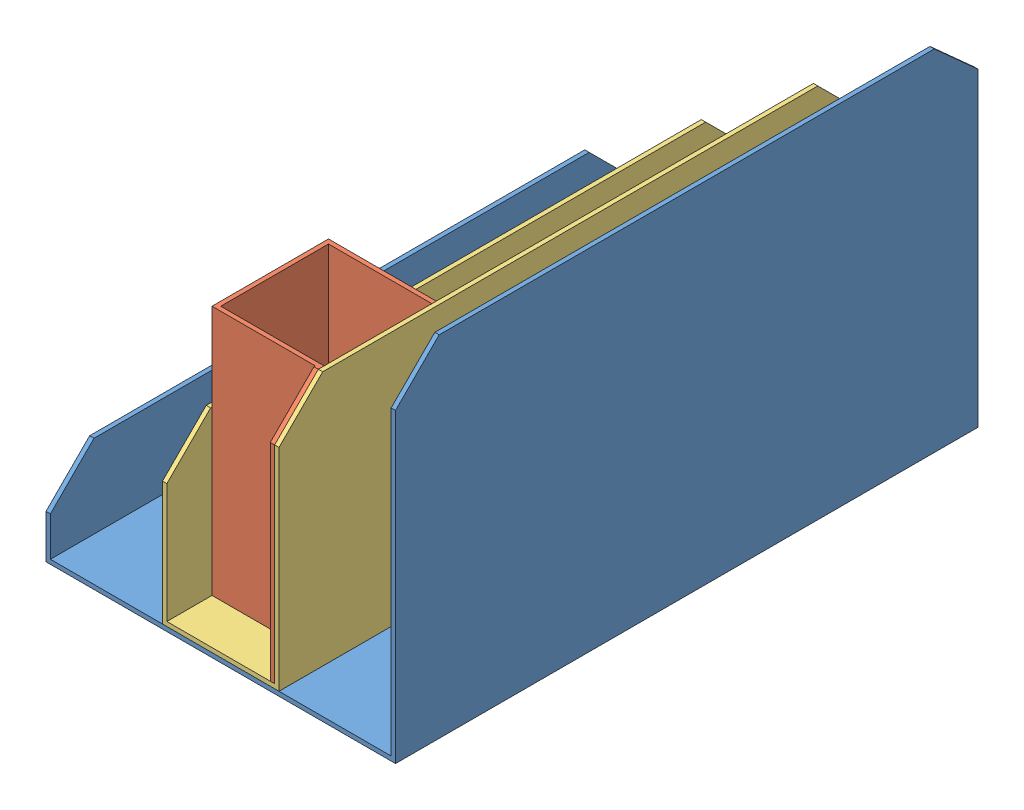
SolidWorks assembly Assemblage du pot.SLDASM, configuration Défaut (file format 3400). Lengths in mm.
Overall size (120 120 200).
3 component instances, 3 part files, 5 mates.
Components (placement in the parent):
- Range crayon-1: Range crayon.SLDPRT [Défaut] at origin size (120 120 200)
- pot-1: pot.SLDPRT [Défaut] at (77 1.5 146) x (0 0 1) z (0 1 0) size (55.5 37 86)
- Range crayon2-1: Range crayon2.SLDPRT [Défaut] at (40 1.5 0) size (40 87.5 200)
Mates (geometry in assembly coordinates):
- Distance1: distance = 38.5 mm anti-aligned: plane of Range crayon-1 through (0 28.5 200) normal (1 0 0); plane of Range crayon2-1 through (38.5 57.5 200) normal (-1 0 0)
- Coïncidente3: coincident aligned: plane of Range crayon-1 through (117 28.5 200) normal (0 0 1); plane of Range crayon2-1 through (78.5 57.5 200) normal (0 0 1)
- Coïncidente6: coincident anti-aligned: plane of pot-1 through (77 1.5 183) normal (0 -1 0); plane of Range crayon2-1 through (40 1.5 200) normal (0 1 0)
- Coïncidente7: coincident anti-aligned: plane of pot-1 through (77 87.5 183) normal (1 0 0); plane of Range crayon2-1 through (77 1.5 200) normal (-1 0 0)
- Coïncidente8: coincident aligned: plane of pot-1 through (75.5 87.5 200) normal (0 0 1); plane of Range crayon2-1 through (78.5 57.5 200) normal (0 0 1)
